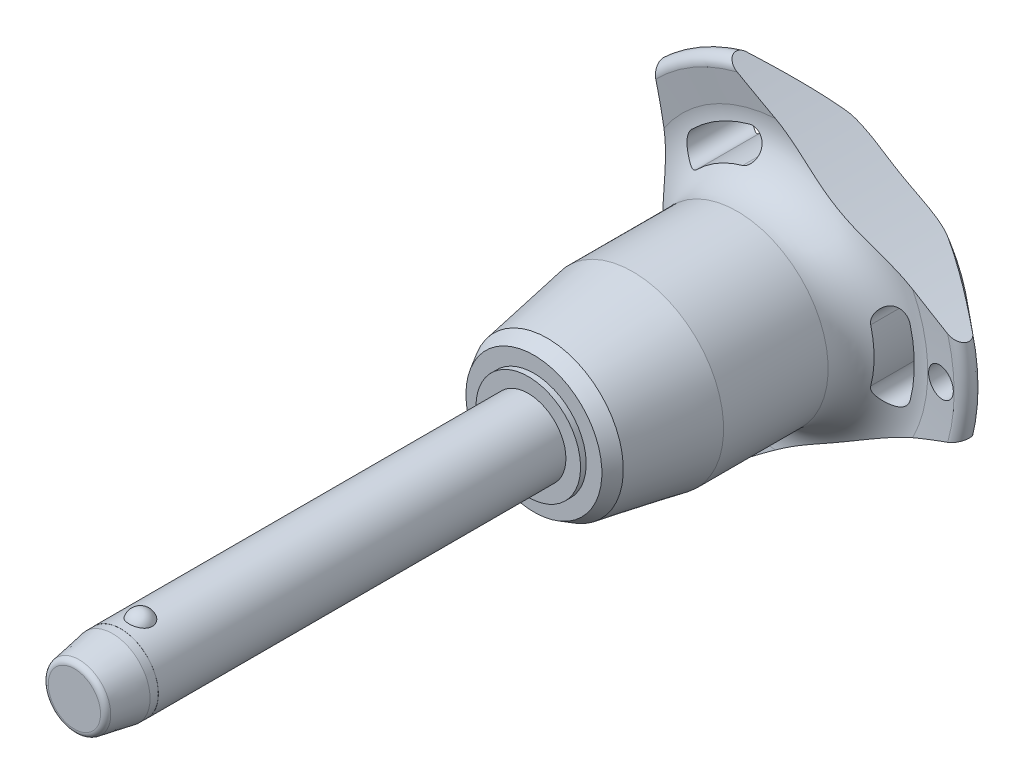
from build123d import *

# Parameters (mm, degrees)
SKETCH1_R           = 4
BOSS_EXTRUDE1_DEPTH = 40
SKETCH2_R           = 3.4
BOSS_EXTRUDE2_DEPTH = 33.3
BOSS_EXTRUDE3_START = 8.2
SKETCH1_2_R         = 4
BOSS_EXTRUDE3_DEPTH = 8.2
CHAMFER1_SIZE       = 4.1
CHAMFER1_SIZE2      = 0.722940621
FILLET1_R           = 0.6
SKETCH6_R           = 102.8
CUT_EXTRUDE1_DEPTH  = 79.369242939
CIRPATTERN1_COUNT   = 3
SKETCH7_R           = 1.5
CUT_EXTRUDE2_DEPTH  = 79.162591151
SKETCH8_R           = 4
SKETCH8_R_2         = 3.99
CUT_EXTRUDE3_DEPTH  = 4.92


with BuildPart() as part:
    # Sketch1 → Boss-Extrude1 (new body)
    with BuildSketch(Plane.XY):
        Circle(SKETCH1_R)
    extrude(amount=-BOSS_EXTRUDE1_DEPTH)

    # Sketch2 → Boss-Extrude2 (add)
    with BuildSketch(Plane(origin=(0, 0, -40), x_dir=(-1, 0, 0), z_dir=(0, 0, -1))):
        Circle(SKETCH2_R)
    extrude(amount=BOSS_EXTRUDE2_DEPTH)

    # Sketch3 → Revolve1 (revolve)
    with BuildSketch(Plane(origin=(0, 0, 0), x_dir=(0, 0, -1), z_dir=(1, 0, 0))):
        with BuildLine():
            Line((-1.2, 4.8), (-1.2, 2.2))
            ThreePointArc((-1.2, 2.2), (0.1, 3.5), (-1.2, 4.8))
        make_face()
        with BuildLine():
            Line((-1.2, -2.2), (-1.2, -4.8))
            ThreePointArc((-1.2, -4.8), (0.1, -3.5), (-1.2, -2.2))
        make_face()
    revolve(axis=Axis((0, -2.2, 1.2), (0, 1, 0)))

    # Sketch1_2 → Boss-Extrude3 (add)
    with BuildSketch(Plane.XY.offset(BOSS_EXTRUDE3_START)):
        Circle(SKETCH1_2_R)
    extrude(amount=-BOSS_EXTRUDE3_DEPTH)

    # Chamfer1
    chamfer1_edges = [part.edges().sort_by_distance(p)[0] for p in [
        (-4, 0, 8.2),
    ]]
    chamfer1_side = [part.faces().sort_by_distance(p)[0] for p in [
        (-4, 0, -15.9),
    ]]
    chamfer(chamfer1_edges, length=CHAMFER1_SIZE, length2=CHAMFER1_SIZE2, reference=chamfer1_side[0])

    # Fillet1
    fillet1_edges = [part.edges().sort_by_distance(p)[0] for p in [
        (-3.277059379, 0, 8.2),
        (3.4, 0, -73.3),
    ]]
    fillet(fillet1_edges, radius=FILLET1_R)

    # Sketch4 → Revolve2 (revolve)
    with BuildSketch(Plane(origin=(0, 0, 0), x_dir=(0, 0, -1), z_dir=(1, 0, 0)), mode=Mode.PRIVATE) as revolve2_sk:
        Polygon((40, 0), (40, 5.554101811), (40.6, 5.554101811), (40.6, 7.220004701), (42.042714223, 8.052956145), (51.1, 9.65), (62.2, 9.65), (62.2, 0), align=None)
    revolve(revolve2_sk.sketch.rotate(Axis((0, 0, -62.2), (0, 0, 1)), 90), axis=Axis((0, 0, -62.2), (0, 0, 1)))

    # Sketch5 → Revolve3 (revolve)
    with BuildSketch(Plane(origin=(0, 0, 0), x_dir=(0, 0, -1), z_dir=(1, 0, 0)), mode=Mode.PRIVATE) as revolve3_sk:
        with BuildLine():
            Line((67.16082631, 15.274661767), (66.757834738, 18.475067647))
            ThreePointArc((66.757834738, 18.475067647), (67.349836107, 19.516443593), (68.516044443, 19.24278761))
            Line((68.516044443, 19.24278761), (72.835691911, 14.094832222))
            ThreePointArc((72.835691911, 14.094832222), (73.3, 12.689260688), (72.67067517, 11.349423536))
            ThreePointArc((72.67067517, 11.349423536), (69.033110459, 6.185112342), (67.75, 0))
            Line((67.75, 0), (62.2, 0))
            Line((62.2, 0), (62.2, 9.65))
            ThreePointArc((62.2, 9.65), (65.949887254, 11.342683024), (67.16082631, 15.274661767))
        make_face()
    revolve(revolve3_sk.sketch.rotate(Axis((0, 0, -67.75), (0, 0, 1)), 90), axis=Axis((0, 0, -67.75), (0, 0, 1)))

    # Sketch6 → Cut-Extrude1 (cut, through all)
    with BuildSketch(Plane.XY):
        with Locations((-115.2, 0)):
            Circle(SKETCH6_R)
        with BuildLine():
            ThreePointArc((13.411913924, -3.529271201), (13.868496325, 0), (13.411913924, 3.529271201))
            ThreePointArc((13.411913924, 3.529271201), (11.694200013, 4.531299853), (10.692171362, 2.813585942))
            ThreePointArc((10.692171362, 2.813585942), (11.056165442, 0), (10.692171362, -2.813585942))
            ThreePointArc((10.692171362, -2.813585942), (11.694200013, -4.531299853), (13.411913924, -3.529271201))
        make_face()
    cut_extrude1 = extrude(amount=-CUT_EXTRUDE1_DEPTH, mode=Mode.SUBTRACT)

    # CirPattern1: Cut-Extrude1 ×3 about axis
    cirpattern1_axis = Axis((0, 0, 0), (0, 0, 1))
    for i in range(1, CIRPATTERN1_COUNT):
        add(cut_extrude1.rotate(cirpattern1_axis, i * 360 / CIRPATTERN1_COUNT), mode=Mode.SUBTRACT)

    # Sketch7 → Cut-Extrude2 (cut, through all)
    with BuildSketch(Plane.XY):
        with Locations(Location((16.868496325, 0, 0), (0, 0, 225.467095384))):
            Circle(SKETCH7_R)
    extrude(amount=-CUT_EXTRUDE2_DEPTH, mode=Mode.SUBTRACT)

    # Sketch8 → Cut-Extrude3 (cut)
    with BuildSketch(Plane.XY.offset(8.2)):
        Circle(SKETCH8_R)
        Circle(SKETCH8_R_2, mode=Mode.SUBTRACT)
    extrude(amount=-CUT_EXTRUDE3_DEPTH, mode=Mode.SUBTRACT)


solid = part.part
